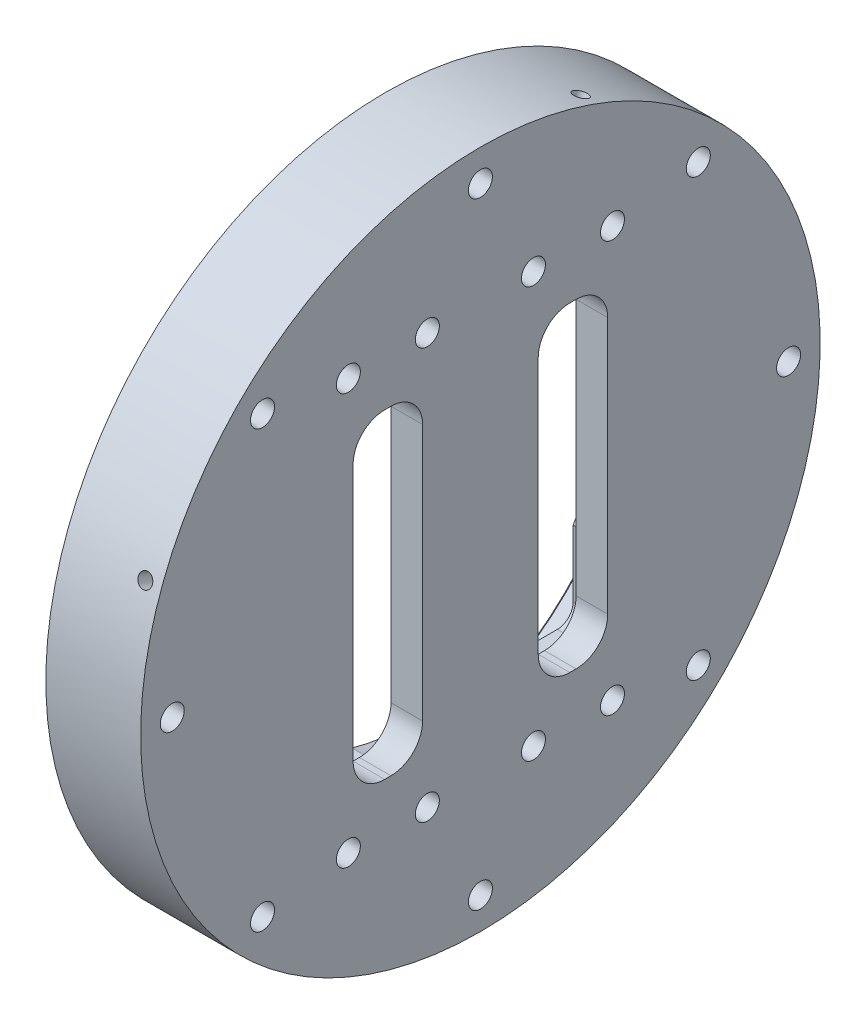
from build123d import *

# Parameters (mm, degrees)
CUT_EXTRUDE1_DEPTH                        = 99.39939183
F_4_40_TAPPED_HOLE1_D                     = 2.2606
F_4_40_TAPPED_HOLE1_DEPTH                 = 7.5946
F_4_40_TAPPED_HOLE1_CBORE_D               = 2.8448
F_4_40_TAPPED_HOLE1_CBORE_DEPTH           = 5.6896
F_4_40_TAPPED_HOLE1_TIP                   = 0.679152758
F_4_40_TAPPED_HOLE1_ON_FACE_2_D           = 2.2606
F_4_40_TAPPED_HOLE1_ON_FACE_2_DEPTH       = 7.5946
F_4_40_TAPPED_HOLE1_ON_FACE_2_CBORE_D     = 2.8448
F_4_40_TAPPED_HOLE1_ON_FACE_2_CBORE_DEPTH = 5.6896
F_4_40_TAPPED_HOLE1_ON_FACE_2_TIP         = 0.679152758
F_4_40_TAPPED_HOLE1_ON_FACE_3_D           = 2.2606
F_4_40_TAPPED_HOLE1_ON_FACE_3_DEPTH       = 7.5946
F_4_40_TAPPED_HOLE1_ON_FACE_3_CBORE_D     = 2.8448
F_4_40_TAPPED_HOLE1_ON_FACE_3_CBORE_DEPTH = 5.6896
F_4_40_TAPPED_HOLE1_ON_FACE_3_TIP         = 0.679152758
F_4_40_TAPPED_HOLE1_ON_FACE_4_D           = 2.2606
F_4_40_TAPPED_HOLE1_ON_FACE_4_DEPTH       = 7.5946
F_4_40_TAPPED_HOLE1_ON_FACE_4_CBORE_D     = 2.8448
F_4_40_TAPPED_HOLE1_ON_FACE_4_CBORE_DEPTH = 5.6896
F_4_40_TAPPED_HOLE1_ON_FACE_4_TIP         = 0.679152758
F_10_32_TAPPED_HOLE1_D                    = 4.0386
F_10_32_TAPPED_HOLE1_DEPTH                = 12.02944
F_10_32_TAPPED_HOLE1_CBORE_D              = 4.826
F_10_32_TAPPED_HOLE1_CBORE_DEPTH          = 9.652
F_10_32_TAPPED_HOLE1_TIP                  = 1.213317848
CUT_EXTRUDE2_DEPTH                        = 8.3566
F_10_32_TAPPED_HOLE2_D                    = 4.826


with BuildPart() as part:
    # Sketch1 → Revolve1 (revolve)
    with BuildSketch(Plane.XY, mode=Mode.PRIVATE) as revolve1_sk:
        Polygon((0, 68.2625), (19.05, 68.2625), (19.05, 0), (12.7, 0), (12.7, 39.6875), (4.3434, 39.6875), (4.3434, 50.9905), (0.508, 50.9905), (0, 51.4985), align=None)
    revolve(revolve1_sk.sketch.rotate(Axis((-7.258509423, 0, 0), (1, 0, 0)), 180), axis=Axis((-7.258509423, 0, 0), (1, 0, 0)))

    # Sketch3 → Cut-Extrude1 (cut, through all)
    with BuildSketch(Plane(origin=(19.05, 0, 0), x_dir=(0, 0, -1), z_dir=(1, 0, 0))):
        with BuildLine():
            Line((-19.23125, 32.1437), (-17.96125, 32.1437))
            ThreePointArc((-17.96125, 32.1437), (-13.471121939, 30.283828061), (-11.61125, 25.7937))
            Line((-11.61125, 25.7937), (-11.61125, -25.7937))
            ThreePointArc((-11.61125, -25.7937), (-13.471121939, -30.283828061), (-17.96125, -32.1437))
            Line((-17.96125, -32.1437), (-19.23125, -32.1437))
            ThreePointArc((-19.23125, -32.1437), (-23.721378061, -30.283828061), (-25.58125, -25.7937))
            Line((-25.58125, -25.7937), (-25.58125, 25.7937))
            ThreePointArc((-25.58125, 25.7937), (-23.721378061, 30.283828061), (-19.23125, 32.1437))
        make_face()
        with BuildLine():
            Line((17.96125, 32.1437), (19.23125, 32.1437))
            ThreePointArc((19.23125, 32.1437), (23.721378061, 30.283828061), (25.58125, 25.7937))
            Line((25.58125, 25.7937), (25.58125, -25.7937))
            ThreePointArc((25.58125, -25.7937), (23.721378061, -30.283828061), (19.23125, -32.1437))
            Line((19.23125, -32.1437), (17.96125, -32.1437))
            ThreePointArc((17.96125, -32.1437), (13.471121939, -30.283828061), (11.61125, -25.7937))
            Line((11.61125, -25.7937), (11.61125, 25.7937))
            ThreePointArc((11.61125, 25.7937), (13.471121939, 30.283828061), (17.96125, 32.1437))
        make_face()
    extrude(amount=-CUT_EXTRUDE1_DEPTH, mode=Mode.SUBTRACT)

    # 4-40 Tapped Hole1
    with Locations(Plane(origin=(15.875, 23.347150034, 64.145767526), x_dir=(0, 0.939692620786, -0.342020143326), z_dir=(0, 0.342020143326, 0.939692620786))):
        with Locations((0, 0)):
            CounterBoreHole(F_4_40_TAPPED_HOLE1_D / 2, F_4_40_TAPPED_HOLE1_CBORE_D / 2, F_4_40_TAPPED_HOLE1_CBORE_DEPTH, depth=F_4_40_TAPPED_HOLE1_DEPTH)
            with Locations((0, 0, -(F_4_40_TAPPED_HOLE1_DEPTH + F_4_40_TAPPED_HOLE1_TIP / 2))):  # 118° drill point
                Cone(0, F_4_40_TAPPED_HOLE1_D / 2, F_4_40_TAPPED_HOLE1_TIP, mode=Mode.SUBTRACT)

    # 4-40 Tapped Hole1 on face 2
    with Locations(Plane(origin=(15.875, -23.347150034, -64.145767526), x_dir=(0, -0.939692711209, 0.342019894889), z_dir=(0, -0.342019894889, -0.939692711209))):
        with Locations((0, 0)):
            CounterBoreHole(F_4_40_TAPPED_HOLE1_ON_FACE_2_D / 2, F_4_40_TAPPED_HOLE1_ON_FACE_2_CBORE_D / 2, F_4_40_TAPPED_HOLE1_ON_FACE_2_CBORE_DEPTH, depth=F_4_40_TAPPED_HOLE1_ON_FACE_2_DEPTH)
            with Locations((0, 0, -(F_4_40_TAPPED_HOLE1_ON_FACE_2_DEPTH + F_4_40_TAPPED_HOLE1_ON_FACE_2_TIP / 2))):  # 118° drill point
                Cone(0, F_4_40_TAPPED_HOLE1_ON_FACE_2_D / 2, F_4_40_TAPPED_HOLE1_ON_FACE_2_TIP, mode=Mode.SUBTRACT)

    # 4-40 Tapped Hole1 on face 3
    with Locations(Plane(origin=(15.875, 64.145767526, -23.347150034), x_dir=(0, 0.342019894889, 0.939692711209), z_dir=(0, 0.939692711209, -0.342019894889))):
        with Locations((0, 0)):
            CounterBoreHole(F_4_40_TAPPED_HOLE1_ON_FACE_3_D / 2, F_4_40_TAPPED_HOLE1_ON_FACE_3_CBORE_D / 2, F_4_40_TAPPED_HOLE1_ON_FACE_3_CBORE_DEPTH, depth=F_4_40_TAPPED_HOLE1_ON_FACE_3_DEPTH)
            with Locations((0, 0, -(F_4_40_TAPPED_HOLE1_ON_FACE_3_DEPTH + F_4_40_TAPPED_HOLE1_ON_FACE_3_TIP / 2))):  # 118° drill point
                Cone(0, F_4_40_TAPPED_HOLE1_ON_FACE_3_D / 2, F_4_40_TAPPED_HOLE1_ON_FACE_3_TIP, mode=Mode.SUBTRACT)

    # 4-40 Tapped Hole1 on face 4
    with Locations(Plane(origin=(15.875, -64.145767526, 23.347150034), x_dir=(0, -0.342019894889, -0.939692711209), z_dir=(0, -0.939692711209, 0.342019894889))):
        with Locations((0, 0)):
            CounterBoreHole(F_4_40_TAPPED_HOLE1_ON_FACE_4_D / 2, F_4_40_TAPPED_HOLE1_ON_FACE_4_CBORE_D / 2, F_4_40_TAPPED_HOLE1_ON_FACE_4_CBORE_DEPTH, depth=F_4_40_TAPPED_HOLE1_ON_FACE_4_DEPTH)
            with Locations((0, 0, -(F_4_40_TAPPED_HOLE1_ON_FACE_4_DEPTH + F_4_40_TAPPED_HOLE1_ON_FACE_4_TIP / 2))):  # 118° drill point
                Cone(0, F_4_40_TAPPED_HOLE1_ON_FACE_4_D / 2, F_4_40_TAPPED_HOLE1_ON_FACE_4_TIP, mode=Mode.SUBTRACT)

    # 10-32 Tapped Hole1
    with Locations(Plane(origin=(19.05, 0, 0), x_dir=(0, 0, -1), z_dir=(1, 0, 0))):
        with Locations((10.65875, 41.275), (26.53375, 41.275), (26.53375, -41.275), (10.65875, -41.275), (-26.53375, 41.275), (-10.65875, 41.275), (-10.65875, -41.275), (-26.53375, -41.275)):
            CounterBoreHole(F_10_32_TAPPED_HOLE1_D / 2, F_10_32_TAPPED_HOLE1_CBORE_D / 2, F_10_32_TAPPED_HOLE1_CBORE_DEPTH, depth=F_10_32_TAPPED_HOLE1_DEPTH)
            with Locations((0, 0, -(F_10_32_TAPPED_HOLE1_DEPTH + F_10_32_TAPPED_HOLE1_TIP / 2))):  # 118° drill point
                Cone(0, F_10_32_TAPPED_HOLE1_D / 2, F_10_32_TAPPED_HOLE1_TIP, mode=Mode.SUBTRACT)

    # Sketch9 → Cut-Extrude2 (cut)
    with BuildSketch(Plane.ZY.offset(-4.3434)):
        with BuildLine():
            Line((-30.1625, 38.1), (30.1625, 38.1))
            ThreePointArc((30.1625, 38.1), (32.40756403, 37.17006403), (33.3375, 34.925))
            Line((33.3375, 34.925), (33.3375, -34.925))
            ThreePointArc((33.3375, -34.925), (32.40756403, -37.17006403), (30.1625, -38.1))
            Line((30.1625, -38.1), (-30.1625, -38.1))
            ThreePointArc((-30.1625, -38.1), (-32.40756403, -37.17006403), (-33.3375, -34.925))
            Line((-33.3375, -34.925), (-33.3375, 34.925))
            ThreePointArc((-33.3375, 34.925), (-32.40756403, 37.17006403), (-30.1625, 38.1))
        make_face()
    extrude(amount=-CUT_EXTRUDE2_DEPTH, mode=Mode.SUBTRACT)

    # 10-32 Tapped Hole2 (through all)
    with Locations(Plane(origin=(19.05, 0, 0), x_dir=(0, 0, -1), z_dir=(1, 0, 0))):
        with Locations((0, 61.9125), (43.77874859, 43.77874859), (61.9125, 0), (43.77874859, -43.77874859), (0, -61.9125), (-43.77874859, -43.77874859), (-61.9125, 0), (-43.77874859, 43.77874859)):
            Hole(F_10_32_TAPPED_HOLE2_D / 2)


solid = part.part
